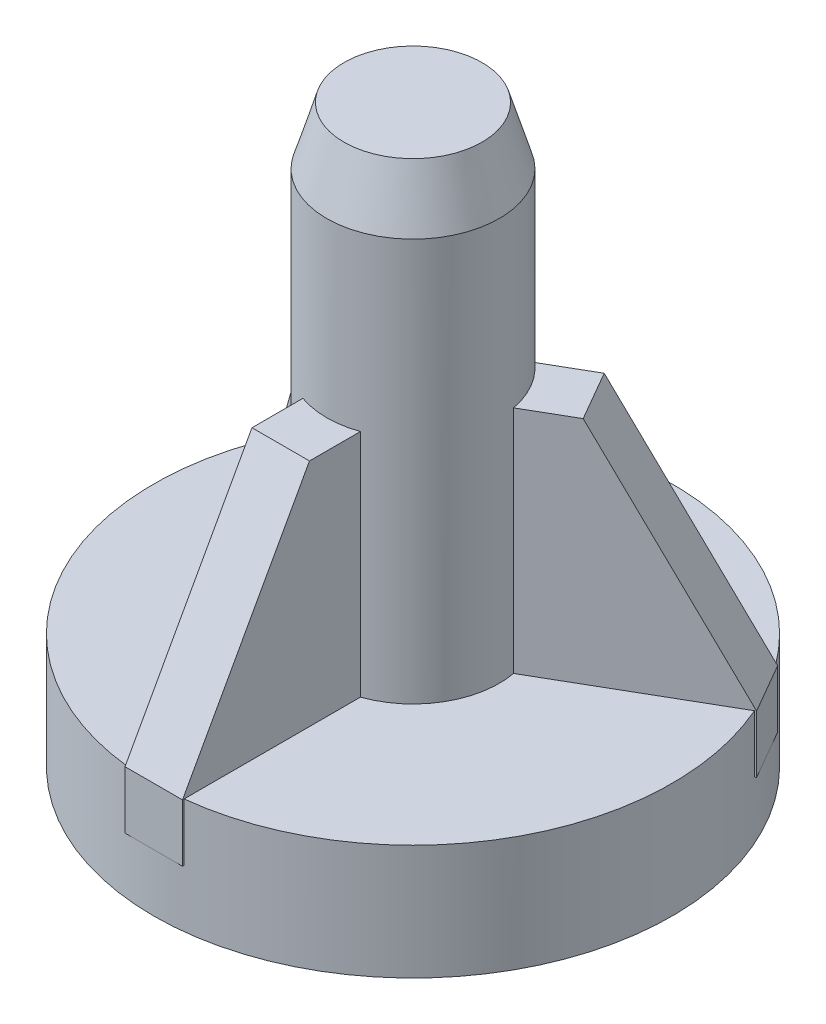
ISO-10303-21;
HEADER;
FILE_DESCRIPTION(('STEP AP214'),'2;1');
FILE_NAME('part.step','',(''),(''),'','','');
FILE_SCHEMA(('AUTOMOTIVE_DESIGN { 1 0 10303 214 1 1 1 1 }'));
ENDSEC;
DATA;
#1=APPLICATION_CONTEXT('core data for automotive mechanical design processes');
#2=APPLICATION_PROTOCOL_DEFINITION('international standard','automotive_design',2000,#1);
#3=PRODUCT_CONTEXT('',#1,'mechanical');
#4=PRODUCT('Part','Part','',(#3));
#5=PRODUCT_RELATED_PRODUCT_CATEGORY('part','',(#4));
#6=PRODUCT_DEFINITION_FORMATION('','',#4);
#7=PRODUCT_DEFINITION_CONTEXT('part definition',#1,'design');
#8=PRODUCT_DEFINITION('design','',#6,#7);
#9=PRODUCT_DEFINITION_SHAPE('','',#8);
#10=(LENGTH_UNIT() NAMED_UNIT(*) SI_UNIT(.MILLI.,.METRE.));
#11=(NAMED_UNIT(*) PLANE_ANGLE_UNIT() SI_UNIT($,.RADIAN.));
#12=(NAMED_UNIT(*) SI_UNIT($,.STERADIAN.) SOLID_ANGLE_UNIT());
#13=UNCERTAINTY_MEASURE_WITH_UNIT(LENGTH_MEASURE(1.E-05),#10,'distance_accuracy_value','');
#14=(GEOMETRIC_REPRESENTATION_CONTEXT(3) GLOBAL_UNCERTAINTY_ASSIGNED_CONTEXT((#13)) GLOBAL_UNIT_ASSIGNED_CONTEXT((#10,
#11,#12)) REPRESENTATION_CONTEXT('',''));
#15=CARTESIAN_POINT('',(0.,0.,0.));
#16=DIRECTION('',(0.,0.,1.));
#17=DIRECTION('',(1.,0.,0.));
#18=AXIS2_PLACEMENT_3D('',#15,#16,#17);
#19=CARTESIAN_POINT('',(0.,40.,0.));
#20=DIRECTION('',(0.,1.,0.));
#21=DIRECTION('',(0.,0.,1.));
#22=AXIS2_PLACEMENT_3D('',#19,#20,#21);
#23=PLANE('',#22);
#24=DIRECTION('',(0.,0.,1.));
#25=VECTOR('',#24,1.);
#26=CARTESIAN_POINT('',(-10.,40.,0.));
#27=LINE('',#26,#25);
#28=CARTESIAN_POINT('',(-10.,40.,28.2842712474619));
#29=VERTEX_POINT('',#28);
#30=CARTESIAN_POINT('',(-10.,40.,89.5965784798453));
#31=VERTEX_POINT('',#30);
#32=EDGE_CURVE('E237',#29,#31,#27,.T.);
#33=ORIENTED_EDGE('',*,*,#32,.F.);
#34=CARTESIAN_POINT('',(0.,40.,0.));
#35=DIRECTION('',(0.,1.,0.));
#36=DIRECTION('',(0.,0.,1.));
#37=AXIS2_PLACEMENT_3D('',#34,#35,#36);
#38=CIRCLE('',#37,30.);
#39=CARTESIAN_POINT('',(-29.4948974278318,40.,-5.48188158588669));
#40=VERTEX_POINT('',#39);
#41=EDGE_CURVE('E360',#40,#29,#38,.T.);
#42=ORIENTED_EDGE('',*,*,#41,.F.);
#43=DIRECTION('',(-0.866025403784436,0.,-0.500000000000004));
#44=VECTOR('',#43,1.);
#45=CARTESIAN_POINT('',(-5.00000000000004,40.,8.66025403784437));
#46=LINE('',#45,#44);
#47=CARTESIAN_POINT('',(-82.592913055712,40.,-36.1380352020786));
#48=VERTEX_POINT('',#47);
#49=EDGE_CURVE('E227',#40,#48,#46,.T.);
#50=ORIENTED_EDGE('',*,*,#49,.T.);
#51=CARTESIAN_POINT('',(0.,40.,0.));
#52=DIRECTION('',(0.,1.,0.));
#53=DIRECTION('',(0.,0.,1.));
#54=AXIS2_PLACEMENT_3D('',#51,#52,#53);
#55=CIRCLE('',#54,90.1529083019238);
#56=EDGE_CURVE('E243',#48,#31,#55,.T.);
#57=ORIENTED_EDGE('',*,*,#56,.T.);
#58=EDGE_LOOP('',(#33,#42,#50,#57));
#59=FACE_BOUND('',#58,.T.);
#60=ADVANCED_FACE('F32',(#59),#23,.T.);
#61=DIRECTION('',(-0.866025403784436,0.,-0.500000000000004));
#62=VECTOR('',#61,1.);
#63=CARTESIAN_POINT('',(5.00000000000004,40.,-8.66025403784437));
#64=LINE('',#63,#62);
#65=CARTESIAN_POINT('',(-19.4948974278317,40.,-22.8023896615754));
#66=VERTEX_POINT('',#65);
#67=CARTESIAN_POINT('',(-72.5929130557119,40.,-53.4585432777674));
#68=VERTEX_POINT('',#67);
#69=EDGE_CURVE('E229',#66,#68,#64,.T.);
#70=ORIENTED_EDGE('',*,*,#69,.F.);
#71=CARTESIAN_POINT('',(19.494897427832,40.,-22.8023896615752));
#72=VERTEX_POINT('',#71);
#73=EDGE_CURVE('E359',#72,#66,#38,.T.);
#74=ORIENTED_EDGE('',*,*,#73,.F.);
#75=DIRECTION('',(0.866025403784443,0.,-0.499999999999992));
#76=VECTOR('',#75,1.);
#77=CARTESIAN_POINT('',(-4.99999999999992,40.,-8.66025403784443));
#78=LINE('',#77,#76);
#79=CARTESIAN_POINT('',(72.5929130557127,40.,-53.4585432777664));
#80=VERTEX_POINT('',#79);
#81=EDGE_CURVE('E203',#72,#80,#78,.T.);
#82=ORIENTED_EDGE('',*,*,#81,.T.);
#83=EDGE_CURVE('E247',#80,#68,#55,.T.);
#84=ORIENTED_EDGE('',*,*,#83,.T.);
#85=EDGE_LOOP('',(#70,#74,#82,#84));
#86=FACE_BOUND('',#85,.T.);
#87=ADVANCED_FACE('F393',(#86),#23,.T.);
#88=DIRECTION('',(0.866025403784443,0.,-0.499999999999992));
#89=VECTOR('',#88,1.);
#90=CARTESIAN_POINT('',(4.99999999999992,40.,8.66025403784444));
#91=LINE('',#90,#89);
#92=CARTESIAN_POINT('',(29.4948974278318,40.,-5.48188158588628));
#93=VERTEX_POINT('',#92);
#94=CARTESIAN_POINT('',(82.5929130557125,40.,-36.1380352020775));
#95=VERTEX_POINT('',#94);
#96=EDGE_CURVE('E221',#93,#95,#91,.T.);
#97=ORIENTED_EDGE('',*,*,#96,.F.);
#98=CARTESIAN_POINT('',(10.,40.,28.2842712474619));
#99=VERTEX_POINT('',#98);
#100=EDGE_CURVE('E47',#99,#93,#38,.T.);
#101=ORIENTED_EDGE('',*,*,#100,.F.);
#102=DIRECTION('',(0.,0.,1.));
#103=VECTOR('',#102,1.);
#104=CARTESIAN_POINT('',(10.,40.,0.));
#105=LINE('',#104,#103);
#106=CARTESIAN_POINT('',(10.,40.,89.5965784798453));
#107=VERTEX_POINT('',#106);
#108=EDGE_CURVE('E235',#99,#107,#105,.T.);
#109=ORIENTED_EDGE('',*,*,#108,.T.);
#110=EDGE_CURVE('E239',#107,#95,#55,.T.);
#111=ORIENTED_EDGE('',*,*,#110,.T.);
#112=EDGE_LOOP('',(#97,#101,#109,#111));
#113=FACE_BOUND('',#112,.T.);
#114=ADVANCED_FACE('F417',(#113),#23,.T.);
#115=CARTESIAN_POINT('',(10.,20.,90.1529083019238));
#116=DIRECTION('',(-1.,0.,0.));
#117=DIRECTION('',(0.,0.,1.));
#118=AXIS2_PLACEMENT_3D('',#115,#116,#117);
#119=PLANE('',#118);
#120=DIRECTION('',(0.,-1.,0.));
#121=VECTOR('',#120,1.);
#122=CARTESIAN_POINT('',(10.,200.,28.2842712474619));
#123=LINE('',#122,#121);
#124=CARTESIAN_POINT('',(10.,120.,28.2842712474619));
#125=VERTEX_POINT('',#124);
#126=EDGE_CURVE('E340',#125,#99,#123,.T.);
#127=ORIENTED_EDGE('',*,*,#126,.F.);
#128=DIRECTION('',(0.,0.,1.));
#129=VECTOR('',#128,1.);
#130=CARTESIAN_POINT('',(10.,120.,46.));
#131=LINE('',#130,#129);
#132=CARTESIAN_POINT('',(10.,120.,46.));
#133=VERTEX_POINT('',#132);
#134=EDGE_CURVE('E279',#125,#133,#131,.T.);
#135=ORIENTED_EDGE('',*,*,#134,.T.);
#136=DIRECTION('',(0.,-0.875508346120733,0.483202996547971));
#137=VECTOR('',#136,1.);
#138=CARTESIAN_POINT('',(10.,40.,90.1529083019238));
#139=LINE('',#138,#137);
#140=CARTESIAN_POINT('',(10.,40.,90.1529083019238));
#141=VERTEX_POINT('',#140);
#142=EDGE_CURVE('E277',#133,#141,#139,.T.);
#143=ORIENTED_EDGE('',*,*,#142,.T.);
#144=DIRECTION('',(0.,-1.,0.));
#145=VECTOR('',#144,1.);
#146=CARTESIAN_POINT('',(10.,20.,90.1529083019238));
#147=LINE('',#146,#145);
#148=CARTESIAN_POINT('',(10.,20.,90.1529083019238));
#149=VERTEX_POINT('',#148);
#150=EDGE_CURVE('E275',#141,#149,#147,.T.);
#151=ORIENTED_EDGE('',*,*,#150,.T.);
#152=DIRECTION('',(0.,0.,-1.));
#153=VECTOR('',#152,1.);
#154=CARTESIAN_POINT('',(10.,20.,28.));
#155=LINE('',#154,#153);
#156=CARTESIAN_POINT('',(10.,20.,89.5965784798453));
#157=VERTEX_POINT('',#156);
#158=EDGE_CURVE('E265',#149,#157,#155,.T.);
#159=ORIENTED_EDGE('',*,*,#158,.T.);
#160=DIRECTION('',(0.,-1.,0.));
#161=VECTOR('',#160,1.);
#162=CARTESIAN_POINT('',(10.,40.,89.5965784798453));
#163=LINE('',#162,#161);
#164=EDGE_CURVE('E244',#157,#107,#163,.F.);
#165=ORIENTED_EDGE('',*,*,#164,.T.);
#166=ORIENTED_EDGE('',*,*,#108,.F.);
#167=EDGE_LOOP('',(#127,#135,#143,#151,#159,#165,#166));
#168=FACE_BOUND('',#167,.T.);
#169=ADVANCED_FACE('F415',(#168),#119,.F.);
#170=CARTESIAN_POINT('',(-10.,20.,90.1529083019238));
#171=DIRECTION('',(-1.,0.,0.));
#172=DIRECTION('',(0.,0.,1.));
#173=AXIS2_PLACEMENT_3D('',#170,#171,#172);
#174=PLANE('',#173);
#175=DIRECTION('',(0.,0.,1.));
#176=VECTOR('',#175,1.);
#177=CARTESIAN_POINT('',(-10.,120.,46.));
#178=LINE('',#177,#176);
#179=CARTESIAN_POINT('',(-10.,120.,28.2842712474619));
#180=VERTEX_POINT('',#179);
#181=CARTESIAN_POINT('',(-10.,120.,46.));
#182=VERTEX_POINT('',#181);
#183=EDGE_CURVE('E269',#180,#182,#178,.T.);
#184=ORIENTED_EDGE('',*,*,#183,.F.);
#185=DIRECTION('',(0.,-1.,0.));
#186=VECTOR('',#185,1.);
#187=CARTESIAN_POINT('',(-10.,200.,28.2842712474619));
#188=LINE('',#187,#186);
#189=EDGE_CURVE('E55',#180,#29,#188,.T.);
#190=ORIENTED_EDGE('',*,*,#189,.T.);
#191=ORIENTED_EDGE('',*,*,#32,.T.);
#192=DIRECTION('',(0.,-1.,0.));
#193=VECTOR('',#192,1.);
#194=CARTESIAN_POINT('',(-10.,40.,89.5965784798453));
#195=LINE('',#194,#193);
#196=CARTESIAN_POINT('',(-10.,20.,89.5965784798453));
#197=VERTEX_POINT('',#196);
#198=EDGE_CURVE('E250',#197,#31,#195,.F.);
#199=ORIENTED_EDGE('',*,*,#198,.F.);
#200=DIRECTION('',(0.,0.,-1.));
#201=VECTOR('',#200,1.);
#202=CARTESIAN_POINT('',(-10.,20.,28.));
#203=LINE('',#202,#201);
#204=CARTESIAN_POINT('',(-10.,20.,90.1529083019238));
#205=VERTEX_POINT('',#204);
#206=EDGE_CURVE('E271',#205,#197,#203,.T.);
#207=ORIENTED_EDGE('',*,*,#206,.F.);
#208=DIRECTION('',(0.,-1.,0.));
#209=VECTOR('',#208,1.);
#210=CARTESIAN_POINT('',(-10.,20.,90.1529083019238));
#211=LINE('',#210,#209);
#212=CARTESIAN_POINT('',(-10.,40.,90.1529083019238));
#213=VERTEX_POINT('',#212);
#214=EDGE_CURVE('E262',#213,#205,#211,.T.);
#215=ORIENTED_EDGE('',*,*,#214,.F.);
#216=DIRECTION('',(0.,-0.875508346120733,0.483202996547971));
#217=VECTOR('',#216,1.);
#218=CARTESIAN_POINT('',(-10.,40.,90.1529083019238));
#219=LINE('',#218,#217);
#220=EDGE_CURVE('E266',#182,#213,#219,.T.);
#221=ORIENTED_EDGE('',*,*,#220,.F.);
#222=EDGE_LOOP('',(#184,#190,#191,#199,#207,#215,#221));
#223=FACE_BOUND('',#222,.T.);
#224=ADVANCED_FACE('F396',(#223),#174,.T.);
#225=CARTESIAN_POINT('',(10.,120.,46.));
#226=DIRECTION('',(0.,-1.,0.));
#227=DIRECTION('',(0.,0.,-1.));
#228=AXIS2_PLACEMENT_3D('',#225,#226,#227);
#229=PLANE('',#228);
#230=CARTESIAN_POINT('',(0.,120.,0.));
#231=DIRECTION('',(0.,-1.,0.));
#232=DIRECTION('',(0.,0.,-1.));
#233=AXIS2_PLACEMENT_3D('',#230,#231,#232);
#234=CIRCLE('',#233,30.);
#235=EDGE_CURVE('E349',#180,#125,#234,.F.);
#236=ORIENTED_EDGE('',*,*,#235,.F.);
#237=ORIENTED_EDGE('',*,*,#183,.T.);
#238=DIRECTION('',(-1.,0.,0.));
#239=VECTOR('',#238,1.);
#240=CARTESIAN_POINT('',(10.,120.,46.));
#241=LINE('',#240,#239);
#242=EDGE_CURVE('E253',#133,#182,#241,.T.);
#243=ORIENTED_EDGE('',*,*,#242,.F.);
#244=ORIENTED_EDGE('',*,*,#134,.F.);
#245=EDGE_LOOP('',(#236,#237,#243,#244));
#246=FACE_BOUND('',#245,.T.);
#247=ADVANCED_FACE('F413',(#246),#229,.F.);
#248=CARTESIAN_POINT('',(-83.0747088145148,20.,-36.4162001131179));
#249=DIRECTION('',(0.500000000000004,0.,-0.866025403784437));
#250=DIRECTION('',(-0.866025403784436,0.,-0.500000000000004));
#251=AXIS2_PLACEMENT_3D('',#248,#249,#250);
#252=PLANE('',#251);
#253=DIRECTION('',(0.,-1.,0.));
#254=VECTOR('',#253,1.);
#255=CARTESIAN_POINT('',(-29.4948974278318,200.,-5.48188158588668));
#256=LINE('',#255,#254);
#257=CARTESIAN_POINT('',(-29.4948974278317,120.,-5.4818815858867));
#258=VERTEX_POINT('',#257);
#259=EDGE_CURVE('E351',#258,#40,#256,.T.);
#260=ORIENTED_EDGE('',*,*,#259,.F.);
#261=DIRECTION('',(-0.866025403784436,0.,-0.500000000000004));
#262=VECTOR('',#261,1.);
#263=CARTESIAN_POINT('',(-44.8371685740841,120.,-14.3397459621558));
#264=LINE('',#263,#262);
#265=CARTESIAN_POINT('',(-44.8371685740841,120.,-14.3397459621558));
#266=VERTEX_POINT('',#265);
#267=EDGE_CURVE('E314',#258,#266,#264,.T.);
#268=ORIENTED_EDGE('',*,*,#267,.T.);
#269=DIRECTION('',(-0.418466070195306,-0.875508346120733,-0.241601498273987));
#270=VECTOR('',#269,1.);
#271=CARTESIAN_POINT('',(-83.0747088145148,40.,-36.4162001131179));
#272=LINE('',#271,#270);
#273=CARTESIAN_POINT('',(-83.0747088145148,40.,-36.4162001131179));
#274=VERTEX_POINT('',#273);
#275=EDGE_CURVE('E312',#266,#274,#272,.T.);
#276=ORIENTED_EDGE('',*,*,#275,.T.);
#277=DIRECTION('',(0.,-1.,0.));
#278=VECTOR('',#277,1.);
#279=CARTESIAN_POINT('',(-83.0747088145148,20.,-36.4162001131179));
#280=LINE('',#279,#278);
#281=CARTESIAN_POINT('',(-83.0747088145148,20.,-36.4162001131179));
#282=VERTEX_POINT('',#281);
#283=EDGE_CURVE('E310',#274,#282,#280,.T.);
#284=ORIENTED_EDGE('',*,*,#283,.T.);
#285=DIRECTION('',(0.866025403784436,0.,0.500000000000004));
#286=VECTOR('',#285,1.);
#287=CARTESIAN_POINT('',(-29.2487113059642,20.,-5.33974596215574));
#288=LINE('',#287,#286);
#289=CARTESIAN_POINT('',(-82.592913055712,20.,-36.1380352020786));
#290=VERTEX_POINT('',#289);
#291=EDGE_CURVE('E300',#282,#290,#288,.T.);
#292=ORIENTED_EDGE('',*,*,#291,.T.);
#293=DIRECTION('',(0.,-1.,0.));
#294=VECTOR('',#293,1.);
#295=CARTESIAN_POINT('',(-82.592913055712,40.,-36.1380352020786));
#296=LINE('',#295,#294);
#297=EDGE_CURVE('E274',#290,#48,#296,.F.);
#298=ORIENTED_EDGE('',*,*,#297,.T.);
#299=ORIENTED_EDGE('',*,*,#49,.F.);
#300=EDGE_LOOP('',(#260,#268,#276,#284,#292,#298,#299));
#301=FACE_BOUND('',#300,.T.);
#302=ADVANCED_FACE('F367',(#301),#252,.F.);
#303=CARTESIAN_POINT('',(-73.0747088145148,20.,-53.7367081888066));
#304=DIRECTION('',(0.500000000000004,0.,-0.866025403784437));
#305=DIRECTION('',(-0.866025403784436,0.,-0.500000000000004));
#306=AXIS2_PLACEMENT_3D('',#303,#304,#305);
#307=PLANE('',#306);
#308=DIRECTION('',(-0.866025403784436,0.,-0.500000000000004));
#309=VECTOR('',#308,1.);
#310=CARTESIAN_POINT('',(-34.837168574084,120.,-31.6602540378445));
#311=LINE('',#310,#309);
#312=CARTESIAN_POINT('',(-19.4948974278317,120.,-22.8023896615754));
#313=VERTEX_POINT('',#312);
#314=CARTESIAN_POINT('',(-34.837168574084,120.,-31.6602540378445));
#315=VERTEX_POINT('',#314);
#316=EDGE_CURVE('E304',#313,#315,#311,.T.);
#317=ORIENTED_EDGE('',*,*,#316,.F.);
#318=DIRECTION('',(0.,-1.,0.));
#319=VECTOR('',#318,1.);
#320=CARTESIAN_POINT('',(-19.4948974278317,200.,-22.8023896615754));
#321=LINE('',#320,#319);
#322=EDGE_CURVE('E354',#313,#66,#321,.T.);
#323=ORIENTED_EDGE('',*,*,#322,.T.);
#324=ORIENTED_EDGE('',*,*,#69,.T.);
#325=DIRECTION('',(0.,-1.,0.));
#326=VECTOR('',#325,1.);
#327=CARTESIAN_POINT('',(-72.592913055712,40.,-53.4585432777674));
#328=LINE('',#327,#326);
#329=CARTESIAN_POINT('',(-72.592913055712,20.,-53.4585432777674));
#330=VERTEX_POINT('',#329);
#331=EDGE_CURVE('E285',#330,#68,#328,.F.);
#332=ORIENTED_EDGE('',*,*,#331,.F.);
#333=DIRECTION('',(0.866025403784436,0.,0.500000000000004));
#334=VECTOR('',#333,1.);
#335=CARTESIAN_POINT('',(-19.2487113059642,20.,-22.6602540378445));
#336=LINE('',#335,#334);
#337=CARTESIAN_POINT('',(-73.0747088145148,20.,-53.7367081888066));
#338=VERTEX_POINT('',#337);
#339=EDGE_CURVE('E306',#338,#330,#336,.T.);
#340=ORIENTED_EDGE('',*,*,#339,.F.);
#341=DIRECTION('',(0.,-1.,0.));
#342=VECTOR('',#341,1.);
#343=CARTESIAN_POINT('',(-73.0747088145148,20.,-53.7367081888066));
#344=LINE('',#343,#342);
#345=CARTESIAN_POINT('',(-73.0747088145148,40.,-53.7367081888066));
#346=VERTEX_POINT('',#345);
#347=EDGE_CURVE('E297',#346,#338,#344,.T.);
#348=ORIENTED_EDGE('',*,*,#347,.F.);
#349=DIRECTION('',(-0.418466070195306,-0.875508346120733,-0.241601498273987));
#350=VECTOR('',#349,1.);
#351=CARTESIAN_POINT('',(-73.0747088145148,40.,-53.7367081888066));
#352=LINE('',#351,#350);
#353=EDGE_CURVE('E301',#315,#346,#352,.T.);
#354=ORIENTED_EDGE('',*,*,#353,.F.);
#355=EDGE_LOOP('',(#317,#323,#324,#332,#340,#348,#354));
#356=FACE_BOUND('',#355,.T.);
#357=ADVANCED_FACE('F388',(#356),#307,.T.);
#358=CARTESIAN_POINT('',(-44.8371685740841,120.,-14.3397459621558));
#359=DIRECTION('',(0.,-1.,0.));
#360=DIRECTION('',(0.,0.,-1.));
#361=AXIS2_PLACEMENT_3D('',#358,#359,#360);
#362=PLANE('',#361);
#363=CARTESIAN_POINT('',(0.,120.,0.));
#364=DIRECTION('',(0.,-1.,0.));
#365=DIRECTION('',(0.,0.,-1.));
#366=AXIS2_PLACEMENT_3D('',#363,#364,#365);
#367=CIRCLE('',#366,30.);
#368=EDGE_CURVE('E206',#313,#258,#367,.F.);
#369=ORIENTED_EDGE('',*,*,#368,.F.);
#370=ORIENTED_EDGE('',*,*,#316,.T.);
#371=DIRECTION('',(0.500000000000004,0.,-0.866025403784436));
#372=VECTOR('',#371,1.);
#373=CARTESIAN_POINT('',(-44.8371685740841,120.,-14.3397459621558));
#374=LINE('',#373,#372);
#375=EDGE_CURVE('E288',#266,#315,#374,.T.);
#376=ORIENTED_EDGE('',*,*,#375,.F.);
#377=ORIENTED_EDGE('',*,*,#267,.F.);
#378=EDGE_LOOP('',(#369,#370,#376,#377));
#379=FACE_BOUND('',#378,.T.);
#380=ADVANCED_FACE('F499',(#379),#362,.F.);
#381=CARTESIAN_POINT('',(73.0747088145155,20.,-53.7367081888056));
#382=DIRECTION('',(0.499999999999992,0.,0.866025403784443));
#383=DIRECTION('',(0.866025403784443,0.,-0.499999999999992));
#384=AXIS2_PLACEMENT_3D('',#381,#382,#383);
#385=PLANE('',#384);
#386=DIRECTION('',(0.,-1.,0.));
#387=VECTOR('',#386,1.);
#388=CARTESIAN_POINT('',(19.494897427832,200.,-22.8023896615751));
#389=LINE('',#388,#387);
#390=CARTESIAN_POINT('',(19.494897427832,120.,-22.8023896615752));
#391=VERTEX_POINT('',#390);
#392=EDGE_CURVE('E200',#391,#72,#389,.T.);
#393=ORIENTED_EDGE('',*,*,#392,.F.);
#394=DIRECTION('',(0.866025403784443,0.,-0.499999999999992));
#395=VECTOR('',#394,1.);
#396=CARTESIAN_POINT('',(34.8371685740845,120.,-31.6602540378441));
#397=LINE('',#396,#395);
#398=CARTESIAN_POINT('',(34.8371685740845,120.,-31.6602540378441));
#399=VERTEX_POINT('',#398);
#400=EDGE_CURVE('E185',#391,#399,#397,.T.);
#401=ORIENTED_EDGE('',*,*,#400,.T.);
#402=DIRECTION('',(0.41846607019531,-0.875508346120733,-0.241601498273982));
#403=VECTOR('',#402,1.);
#404=CARTESIAN_POINT('',(73.0747088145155,40.,-53.7367081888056));
#405=LINE('',#404,#403);
#406=CARTESIAN_POINT('',(73.0747088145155,40.,-53.7367081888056));
#407=VERTEX_POINT('',#406);
#408=EDGE_CURVE('E195',#399,#407,#405,.T.);
#409=ORIENTED_EDGE('',*,*,#408,.T.);
#410=DIRECTION('',(0.,-1.,0.));
#411=VECTOR('',#410,1.);
#412=CARTESIAN_POINT('',(73.0747088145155,20.,-53.7367081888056));
#413=LINE('',#412,#411);
#414=CARTESIAN_POINT('',(73.0747088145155,20.,-53.7367081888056));
#415=VERTEX_POINT('',#414);
#416=EDGE_CURVE('E341',#407,#415,#413,.T.);
#417=ORIENTED_EDGE('',*,*,#416,.T.);
#418=DIRECTION('',(-0.866025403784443,0.,0.499999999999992));
#419=VECTOR('',#418,1.);
#420=CARTESIAN_POINT('',(19.2487113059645,20.,-22.6602540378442));
#421=LINE('',#420,#419);
#422=CARTESIAN_POINT('',(72.5929130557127,20.,-53.4585432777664));
#423=VERTEX_POINT('',#422);
#424=EDGE_CURVE('E196',#415,#423,#421,.T.);
#425=ORIENTED_EDGE('',*,*,#424,.T.);
#426=DIRECTION('',(0.,-1.,0.));
#427=VECTOR('',#426,1.);
#428=CARTESIAN_POINT('',(72.5929130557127,40.,-53.4585432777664));
#429=LINE('',#428,#427);
#430=EDGE_CURVE('E309',#423,#80,#429,.F.);
#431=ORIENTED_EDGE('',*,*,#430,.T.);
#432=ORIENTED_EDGE('',*,*,#81,.F.);
#433=EDGE_LOOP('',(#393,#401,#409,#417,#425,#431,#432));
#434=FACE_BOUND('',#433,.T.);
#435=ADVANCED_FACE('F201',(#434),#385,.F.);
#436=CARTESIAN_POINT('',(83.0747088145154,20.,-36.4162001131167));
#437=DIRECTION('',(0.499999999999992,0.,0.866025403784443));
#438=DIRECTION('',(0.866025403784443,0.,-0.499999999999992));
#439=AXIS2_PLACEMENT_3D('',#436,#437,#438);
#440=PLANE('',#439);
#441=DIRECTION('',(0.866025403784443,0.,-0.499999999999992));
#442=VECTOR('',#441,1.);
#443=CARTESIAN_POINT('',(44.8371685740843,120.,-14.3397459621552));
#444=LINE('',#443,#442);
#445=CARTESIAN_POINT('',(29.4948974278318,120.,-5.48188158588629));
#446=VERTEX_POINT('',#445);
#447=CARTESIAN_POINT('',(44.8371685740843,120.,-14.3397459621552));
#448=VERTEX_POINT('',#447);
#449=EDGE_CURVE('E335',#446,#448,#444,.T.);
#450=ORIENTED_EDGE('',*,*,#449,.F.);
#451=DIRECTION('',(0.,-1.,0.));
#452=VECTOR('',#451,1.);
#453=CARTESIAN_POINT('',(29.4948974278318,200.,-5.48188158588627));
#454=LINE('',#453,#452);
#455=EDGE_CURVE('E207',#446,#93,#454,.T.);
#456=ORIENTED_EDGE('',*,*,#455,.T.);
#457=ORIENTED_EDGE('',*,*,#96,.T.);
#458=DIRECTION('',(0.,-1.,0.));
#459=VECTOR('',#458,1.);
#460=CARTESIAN_POINT('',(82.5929130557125,40.,-36.1380352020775));
#461=LINE('',#460,#459);
#462=CARTESIAN_POINT('',(82.5929130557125,20.,-36.1380352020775));
#463=VERTEX_POINT('',#462);
#464=EDGE_CURVE('E319',#463,#95,#461,.F.);
#465=ORIENTED_EDGE('',*,*,#464,.F.);
#466=DIRECTION('',(-0.866025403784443,0.,0.499999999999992));
#467=VECTOR('',#466,1.);
#468=CARTESIAN_POINT('',(29.2487113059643,20.,-5.33974596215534));
#469=LINE('',#468,#467);
#470=CARTESIAN_POINT('',(83.0747088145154,20.,-36.4162001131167));
#471=VERTEX_POINT('',#470);
#472=EDGE_CURVE('E337',#471,#463,#469,.T.);
#473=ORIENTED_EDGE('',*,*,#472,.F.);
#474=DIRECTION('',(0.,-1.,0.));
#475=VECTOR('',#474,1.);
#476=CARTESIAN_POINT('',(83.0747088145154,20.,-36.4162001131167));
#477=LINE('',#476,#475);
#478=CARTESIAN_POINT('',(83.0747088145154,40.,-36.4162001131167));
#479=VERTEX_POINT('',#478);
#480=EDGE_CURVE('E329',#479,#471,#477,.T.);
#481=ORIENTED_EDGE('',*,*,#480,.F.);
#482=DIRECTION('',(0.41846607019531,-0.875508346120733,-0.241601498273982));
#483=VECTOR('',#482,1.);
#484=CARTESIAN_POINT('',(83.0747088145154,40.,-36.4162001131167));
#485=LINE('',#484,#483);
#486=EDGE_CURVE('E332',#448,#479,#485,.T.);
#487=ORIENTED_EDGE('',*,*,#486,.F.);
#488=EDGE_LOOP('',(#450,#456,#457,#465,#473,#481,#487));
#489=FACE_BOUND('',#488,.T.);
#490=ADVANCED_FACE('F422',(#489),#440,.T.);
#491=CARTESIAN_POINT('',(34.8371685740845,120.,-31.6602540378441));
#492=DIRECTION('',(0.,-1.,0.));
#493=DIRECTION('',(0.,0.,-1.));
#494=AXIS2_PLACEMENT_3D('',#491,#492,#493);
#495=PLANE('',#494);
#496=CARTESIAN_POINT('',(0.,120.,0.));
#497=DIRECTION('',(0.,-1.,0.));
#498=DIRECTION('',(0.,0.,-1.));
#499=AXIS2_PLACEMENT_3D('',#496,#497,#498);
#500=CIRCLE('',#499,30.);
#501=EDGE_CURVE('E189',#446,#391,#500,.F.);
#502=ORIENTED_EDGE('',*,*,#501,.F.);
#503=ORIENTED_EDGE('',*,*,#449,.T.);
#504=DIRECTION('',(0.499999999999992,0.,0.866025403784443));
#505=VECTOR('',#504,1.);
#506=CARTESIAN_POINT('',(34.8371685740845,120.,-31.6602540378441));
#507=LINE('',#506,#505);
#508=EDGE_CURVE('E192',#399,#448,#507,.T.);
#509=ORIENTED_EDGE('',*,*,#508,.F.);
#510=ORIENTED_EDGE('',*,*,#400,.F.);
#511=EDGE_LOOP('',(#502,#503,#509,#510));
#512=FACE_BOUND('',#511,.T.);
#513=ADVANCED_FACE('F187',(#512),#495,.F.);
#514=CARTESIAN_POINT('',(0.,40.,0.));
#515=DIRECTION('',(0.,-1.,0.));
#516=DIRECTION('',(0.,0.,-1.));
#517=AXIS2_PLACEMENT_3D('',#514,#515,#516);
#518=CYLINDRICAL_SURFACE('',#517,90.1529083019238);
#519=CARTESIAN_POINT('',(0.,0.,0.));
#520=DIRECTION('',(0.,1.,0.));
#521=DIRECTION('',(0.,0.,1.));
#522=AXIS2_PLACEMENT_3D('',#519,#520,#521);
#523=CIRCLE('',#522,90.1529083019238);
#524=CARTESIAN_POINT('',(0.,0.,90.1529083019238));
#525=VERTEX_POINT('',#524);
#526=EDGE_CURVE('E240',#525,#525,#523,.T.);
#527=ORIENTED_EDGE('',*,*,#526,.T.);
#528=EDGE_LOOP('',(#527));
#529=FACE_BOUND('',#528,.T.);
#530=CARTESIAN_POINT('',(0.,20.,0.));
#531=DIRECTION('',(0.,1.,0.));
#532=DIRECTION('',(-1.,0.,0.));
#533=AXIS2_PLACEMENT_3D('',#530,#531,#532);
#534=CIRCLE('',#533,90.1529083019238);
#535=CARTESIAN_POINT('',(78.0747088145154,20.,-45.0764541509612));
#536=VERTEX_POINT('',#535);
#537=EDGE_CURVE('E212',#536,#423,#534,.T.);
#538=ORIENTED_EDGE('',*,*,#537,.F.);
#539=EDGE_CURVE('E216',#463,#536,#534,.T.);
#540=ORIENTED_EDGE('',*,*,#539,.F.);
#541=ORIENTED_EDGE('',*,*,#464,.T.);
#542=ORIENTED_EDGE('',*,*,#110,.F.);
#543=ORIENTED_EDGE('',*,*,#164,.F.);
#544=CARTESIAN_POINT('',(0.,20.,0.));
#545=DIRECTION('',(0.,1.,0.));
#546=DIRECTION('',(0.,0.,1.));
#547=AXIS2_PLACEMENT_3D('',#544,#545,#546);
#548=CIRCLE('',#547,90.1529083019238);
#549=CARTESIAN_POINT('',(0.,20.,90.1529083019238));
#550=VERTEX_POINT('',#549);
#551=EDGE_CURVE('E231',#550,#157,#548,.T.);
#552=ORIENTED_EDGE('',*,*,#551,.F.);
#553=EDGE_CURVE('E232',#197,#550,#548,.T.);
#554=ORIENTED_EDGE('',*,*,#553,.F.);
#555=ORIENTED_EDGE('',*,*,#198,.T.);
#556=ORIENTED_EDGE('',*,*,#56,.F.);
#557=ORIENTED_EDGE('',*,*,#297,.F.);
#558=CARTESIAN_POINT('',(0.,20.,0.));
#559=DIRECTION('',(0.,1.,0.));
#560=DIRECTION('',(-1.,0.,0.));
#561=AXIS2_PLACEMENT_3D('',#558,#559,#560);
#562=CIRCLE('',#561,90.1529083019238);
#563=CARTESIAN_POINT('',(-78.0747088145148,20.,-45.0764541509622));
#564=VERTEX_POINT('',#563);
#565=EDGE_CURVE('E223',#564,#290,#562,.T.);
#566=ORIENTED_EDGE('',*,*,#565,.F.);
#567=EDGE_CURVE('E224',#330,#564,#562,.T.);
#568=ORIENTED_EDGE('',*,*,#567,.F.);
#569=ORIENTED_EDGE('',*,*,#331,.T.);
#570=ORIENTED_EDGE('',*,*,#83,.F.);
#571=ORIENTED_EDGE('',*,*,#430,.F.);
#572=EDGE_LOOP('',(#538,#540,#541,#542,#543,#552,#554,#555,#556,#557,#566,#568,#569,#570,#571));
#573=FACE_BOUND('',#572,.T.);
#574=ADVANCED_FACE('F372',(#529,#573),#518,.T.);
#575=CARTESIAN_POINT('',(0.,0.,0.));
#576=DIRECTION('',(0.,1.,0.));
#577=DIRECTION('',(0.,0.,1.));
#578=AXIS2_PLACEMENT_3D('',#575,#576,#577);
#579=PLANE('',#578);
#580=ORIENTED_EDGE('',*,*,#526,.F.);
#581=EDGE_LOOP('',(#580));
#582=FACE_BOUND('',#581,.T.);
#583=ADVANCED_FACE('F474',(#582),#579,.F.);
#584=CARTESIAN_POINT('',(10.,20.,28.));
#585=DIRECTION('',(0.,1.,0.));
#586=DIRECTION('',(0.,0.,1.));
#587=AXIS2_PLACEMENT_3D('',#584,#585,#586);
#588=PLANE('',#587);
#589=DIRECTION('',(-1.,0.,0.));
#590=VECTOR('',#589,1.);
#591=CARTESIAN_POINT('',(10.,20.,90.1529083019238));
#592=LINE('',#591,#590);
#593=EDGE_CURVE('E258',#149,#550,#592,.T.);
#594=ORIENTED_EDGE('',*,*,#593,.T.);
#595=ORIENTED_EDGE('',*,*,#551,.T.);
#596=ORIENTED_EDGE('',*,*,#158,.F.);
#597=EDGE_LOOP('',(#594,#595,#596));
#598=FACE_BOUND('',#597,.T.);
#599=ADVANCED_FACE('F472',(#598),#588,.F.);
#600=ORIENTED_EDGE('',*,*,#206,.T.);
#601=ORIENTED_EDGE('',*,*,#553,.T.);
#602=EDGE_CURVE('E261',#550,#205,#592,.T.);
#603=ORIENTED_EDGE('',*,*,#602,.T.);
#604=EDGE_LOOP('',(#600,#601,#603));
#605=FACE_BOUND('',#604,.T.);
#606=ADVANCED_FACE('F399',(#605),#588,.F.);
#607=CARTESIAN_POINT('',(10.,20.,90.1529083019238));
#608=DIRECTION('',(0.,0.,-1.));
#609=DIRECTION('',(-1.,0.,0.));
#610=AXIS2_PLACEMENT_3D('',#607,#608,#609);
#611=PLANE('',#610);
#612=DIRECTION('',(-1.,0.,0.));
#613=VECTOR('',#612,1.);
#614=CARTESIAN_POINT('',(10.,40.,90.1529083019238));
#615=LINE('',#614,#613);
#616=EDGE_CURVE('E256',#141,#213,#615,.T.);
#617=ORIENTED_EDGE('',*,*,#616,.T.);
#618=ORIENTED_EDGE('',*,*,#214,.T.);
#619=ORIENTED_EDGE('',*,*,#602,.F.);
#620=ORIENTED_EDGE('',*,*,#593,.F.);
#621=ORIENTED_EDGE('',*,*,#150,.F.);
#622=EDGE_LOOP('',(#617,#618,#619,#620,#621));
#623=FACE_BOUND('',#622,.T.);
#624=ADVANCED_FACE('F403',(#623),#611,.F.);
#625=CARTESIAN_POINT('',(10.,40.,90.1529083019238));
#626=DIRECTION('',(0.,-0.483202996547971,-0.875508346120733));
#627=DIRECTION('',(0.,0.875508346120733,-0.483202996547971));
#628=AXIS2_PLACEMENT_3D('',#625,#626,#627);
#629=PLANE('',#628);
#630=ORIENTED_EDGE('',*,*,#220,.T.);
#631=ORIENTED_EDGE('',*,*,#616,.F.);
#632=ORIENTED_EDGE('',*,*,#142,.F.);
#633=ORIENTED_EDGE('',*,*,#242,.T.);
#634=EDGE_LOOP('',(#630,#631,#632,#633));
#635=FACE_BOUND('',#634,.T.);
#636=ADVANCED_FACE('F408',(#635),#629,.F.);
#637=CARTESIAN_POINT('',(-29.2487113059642,20.,-5.33974596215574));
#638=DIRECTION('',(0.,1.,0.));
#639=DIRECTION('',(-1.,0.,0.));
#640=AXIS2_PLACEMENT_3D('',#637,#638,#639);
#641=PLANE('',#640);
#642=ORIENTED_EDGE('',*,*,#339,.T.);
#643=ORIENTED_EDGE('',*,*,#567,.T.);
#644=DIRECTION('',(0.500000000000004,0.,-0.866025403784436));
#645=VECTOR('',#644,1.);
#646=CARTESIAN_POINT('',(-83.0747088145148,20.,-36.4162001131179));
#647=LINE('',#646,#645);
#648=EDGE_CURVE('E296',#564,#338,#647,.T.);
#649=ORIENTED_EDGE('',*,*,#648,.T.);
#650=EDGE_LOOP('',(#642,#643,#649));
#651=FACE_BOUND('',#650,.T.);
#652=ADVANCED_FACE('F383',(#651),#641,.F.);
#653=EDGE_CURVE('E293',#282,#564,#647,.T.);
#654=ORIENTED_EDGE('',*,*,#653,.T.);
#655=ORIENTED_EDGE('',*,*,#565,.T.);
#656=ORIENTED_EDGE('',*,*,#291,.F.);
#657=EDGE_LOOP('',(#654,#655,#656));
#658=FACE_BOUND('',#657,.T.);
#659=ADVANCED_FACE('F374',(#658),#641,.F.);
#660=CARTESIAN_POINT('',(-83.0747088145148,20.,-36.4162001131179));
#661=DIRECTION('',(0.866025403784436,0.,0.500000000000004));
#662=DIRECTION('',(0.500000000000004,0.,-0.866025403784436));
#663=AXIS2_PLACEMENT_3D('',#660,#661,#662);
#664=PLANE('',#663);
#665=DIRECTION('',(0.500000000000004,0.,-0.866025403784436));
#666=VECTOR('',#665,1.);
#667=CARTESIAN_POINT('',(-83.0747088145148,40.,-36.4162001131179));
#668=LINE('',#667,#666);
#669=EDGE_CURVE('E291',#274,#346,#668,.T.);
#670=ORIENTED_EDGE('',*,*,#669,.T.);
#671=ORIENTED_EDGE('',*,*,#347,.T.);
#672=ORIENTED_EDGE('',*,*,#648,.F.);
#673=ORIENTED_EDGE('',*,*,#653,.F.);
#674=ORIENTED_EDGE('',*,*,#283,.F.);
#675=EDGE_LOOP('',(#670,#671,#672,#673,#674));
#676=FACE_BOUND('',#675,.T.);
#677=ADVANCED_FACE('F379',(#676),#664,.F.);
#678=CARTESIAN_POINT('',(-83.0747088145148,40.,-36.4162001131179));
#679=DIRECTION('',(0.758212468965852,-0.483202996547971,0.43775417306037));
#680=DIRECTION('',(0.537432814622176,0.843306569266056,0.));
#681=AXIS2_PLACEMENT_3D('',#678,#679,#680);
#682=PLANE('',#681);
#683=ORIENTED_EDGE('',*,*,#353,.T.);
#684=ORIENTED_EDGE('',*,*,#669,.F.);
#685=ORIENTED_EDGE('',*,*,#275,.F.);
#686=ORIENTED_EDGE('',*,*,#375,.T.);
#687=EDGE_LOOP('',(#683,#684,#685,#686));
#688=FACE_BOUND('',#687,.T.);
#689=ADVANCED_FACE('F445',(#688),#682,.F.);
#690=CARTESIAN_POINT('',(19.2487113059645,20.,-22.6602540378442));
#691=DIRECTION('',(0.,1.,0.));
#692=DIRECTION('',(-1.,0.,0.));
#693=AXIS2_PLACEMENT_3D('',#690,#691,#692);
#694=PLANE('',#693);
#695=ORIENTED_EDGE('',*,*,#472,.T.);
#696=ORIENTED_EDGE('',*,*,#539,.T.);
#697=DIRECTION('',(0.499999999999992,0.,0.866025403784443));
#698=VECTOR('',#697,1.);
#699=CARTESIAN_POINT('',(73.0747088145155,20.,-53.7367081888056));
#700=LINE('',#699,#698);
#701=EDGE_CURVE('E328',#536,#471,#700,.T.);
#702=ORIENTED_EDGE('',*,*,#701,.T.);
#703=EDGE_LOOP('',(#695,#696,#702));
#704=FACE_BOUND('',#703,.T.);
#705=ADVANCED_FACE('F425',(#704),#694,.F.);
#706=EDGE_CURVE('E325',#415,#536,#700,.T.);
#707=ORIENTED_EDGE('',*,*,#706,.T.);
#708=ORIENTED_EDGE('',*,*,#537,.T.);
#709=ORIENTED_EDGE('',*,*,#424,.F.);
#710=EDGE_LOOP('',(#707,#708,#709));
#711=FACE_BOUND('',#710,.T.);
#712=ADVANCED_FACE('F437',(#711),#694,.F.);
#713=CARTESIAN_POINT('',(73.0747088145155,20.,-53.7367081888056));
#714=DIRECTION('',(-0.866025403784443,0.,0.499999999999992));
#715=DIRECTION('',(0.499999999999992,0.,0.866025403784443));
#716=AXIS2_PLACEMENT_3D('',#713,#714,#715);
#717=PLANE('',#716);
#718=DIRECTION('',(0.499999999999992,0.,0.866025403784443));
#719=VECTOR('',#718,1.);
#720=CARTESIAN_POINT('',(73.0747088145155,40.,-53.7367081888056));
#721=LINE('',#720,#719);
#722=EDGE_CURVE('E323',#407,#479,#721,.T.);
#723=ORIENTED_EDGE('',*,*,#722,.T.);
#724=ORIENTED_EDGE('',*,*,#480,.T.);
#725=ORIENTED_EDGE('',*,*,#701,.F.);
#726=ORIENTED_EDGE('',*,*,#706,.F.);
#727=ORIENTED_EDGE('',*,*,#416,.F.);
#728=EDGE_LOOP('',(#723,#724,#725,#726,#727));
#729=FACE_BOUND('',#728,.T.);
#730=ADVANCED_FACE('F429',(#729),#717,.F.);
#731=CARTESIAN_POINT('',(73.0747088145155,40.,-53.7367081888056));
#732=DIRECTION('',(-0.758212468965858,-0.483202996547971,0.43775417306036));
#733=DIRECTION('',(0.537432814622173,-0.843306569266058,0.));
#734=AXIS2_PLACEMENT_3D('',#731,#732,#733);
#735=PLANE('',#734);
#736=ORIENTED_EDGE('',*,*,#486,.T.);
#737=ORIENTED_EDGE('',*,*,#722,.F.);
#738=ORIENTED_EDGE('',*,*,#408,.F.);
#739=ORIENTED_EDGE('',*,*,#508,.T.);
#740=EDGE_LOOP('',(#736,#737,#738,#739));
#741=FACE_BOUND('',#740,.T.);
#742=ADVANCED_FACE('F434',(#741),#735,.F.);
#743=CARTESIAN_POINT('',(0.,200.,0.));
#744=DIRECTION('',(0.,-1.,0.));
#745=DIRECTION('',(0.,0.,-1.));
#746=AXIS2_PLACEMENT_3D('',#743,#744,#745);
#747=CYLINDRICAL_SURFACE('',#746,30.);
#748=CARTESIAN_POINT('',(0.,180.,0.));
#749=DIRECTION('',(0.,1.,0.));
#750=DIRECTION('',(0.,0.,1.));
#751=AXIS2_PLACEMENT_3D('',#748,#749,#750);
#752=CIRCLE('',#751,30.);
#753=CARTESIAN_POINT('',(0.,180.,30.));
#754=VERTEX_POINT('',#753);
#755=EDGE_CURVE('E11',#754,#754,#752,.F.);
#756=ORIENTED_EDGE('',*,*,#755,.T.);
#757=EDGE_LOOP('',(#756));
#758=FACE_BOUND('',#757,.T.);
#759=ORIENTED_EDGE('',*,*,#235,.T.);
#760=ORIENTED_EDGE('',*,*,#126,.T.);
#761=ORIENTED_EDGE('',*,*,#100,.T.);
#762=ORIENTED_EDGE('',*,*,#455,.F.);
#763=ORIENTED_EDGE('',*,*,#501,.T.);
#764=ORIENTED_EDGE('',*,*,#392,.T.);
#765=ORIENTED_EDGE('',*,*,#73,.T.);
#766=ORIENTED_EDGE('',*,*,#322,.F.);
#767=ORIENTED_EDGE('',*,*,#368,.T.);
#768=ORIENTED_EDGE('',*,*,#259,.T.);
#769=ORIENTED_EDGE('',*,*,#41,.T.);
#770=ORIENTED_EDGE('',*,*,#189,.F.);
#771=EDGE_LOOP('',(#759,#760,#761,#762,#763,#764,#765,#766,#767,#768,#769,#770));
#772=FACE_BOUND('',#771,.T.);
#773=ADVANCED_FACE('F211',(#758,#772),#747,.T.);
#774=CARTESIAN_POINT('',(0.,200.,0.));
#775=DIRECTION('',(0.,1.,0.));
#776=DIRECTION('',(0.,0.,1.));
#777=AXIS2_PLACEMENT_3D('',#774,#775,#776);
#778=PLANE('',#777);
#779=CARTESIAN_POINT('',(0.,200.,0.));
#780=DIRECTION('',(0.,1.,0.));
#781=DIRECTION('',(0.,0.,1.));
#782=AXIS2_PLACEMENT_3D('',#779,#780,#781);
#783=CIRCLE('',#782,24.);
#784=CARTESIAN_POINT('',(0.,200.,24.));
#785=VERTEX_POINT('',#784);
#786=EDGE_CURVE('E40',#785,#785,#783,.T.);
#787=ORIENTED_EDGE('',*,*,#786,.T.);
#788=EDGE_LOOP('',(#787));
#789=FACE_BOUND('',#788,.T.);
#790=ADVANCED_FACE('F502',(#789),#778,.T.);
#791=CARTESIAN_POINT('',(0.,200.,0.));
#792=DIRECTION('',(0.,-1.,0.));
#793=DIRECTION('',(0.,0.,-1.));
#794=AXIS2_PLACEMENT_3D('',#791,#792,#793);
#795=CONICAL_SURFACE('',#794,24.,0.291456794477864);
#796=ORIENTED_EDGE('',*,*,#755,.F.);
#797=EDGE_LOOP('',(#796));
#798=FACE_BOUND('',#797,.T.);
#799=ORIENTED_EDGE('',*,*,#786,.F.);
#800=EDGE_LOOP('',(#799));
#801=FACE_BOUND('',#800,.T.);
#802=ADVANCED_FACE('F34',(#798,#801),#795,.T.);
#803=CLOSED_SHELL('',(#60,#87,#114,#169,#224,#247,#302,#357,#380,#435,#490,#513,#574,#583,#599,
#606,#624,#636,#652,#659,#677,#689,#705,#712,#730,#742,#773,#790,#802));
#804=MANIFOLD_SOLID_BREP('B2',#803);
#805=ADVANCED_BREP_SHAPE_REPRESENTATION('',(#18,#804),#14);
#806=SHAPE_DEFINITION_REPRESENTATION(#9,#805);
ENDSEC;
END-ISO-10303-21;
